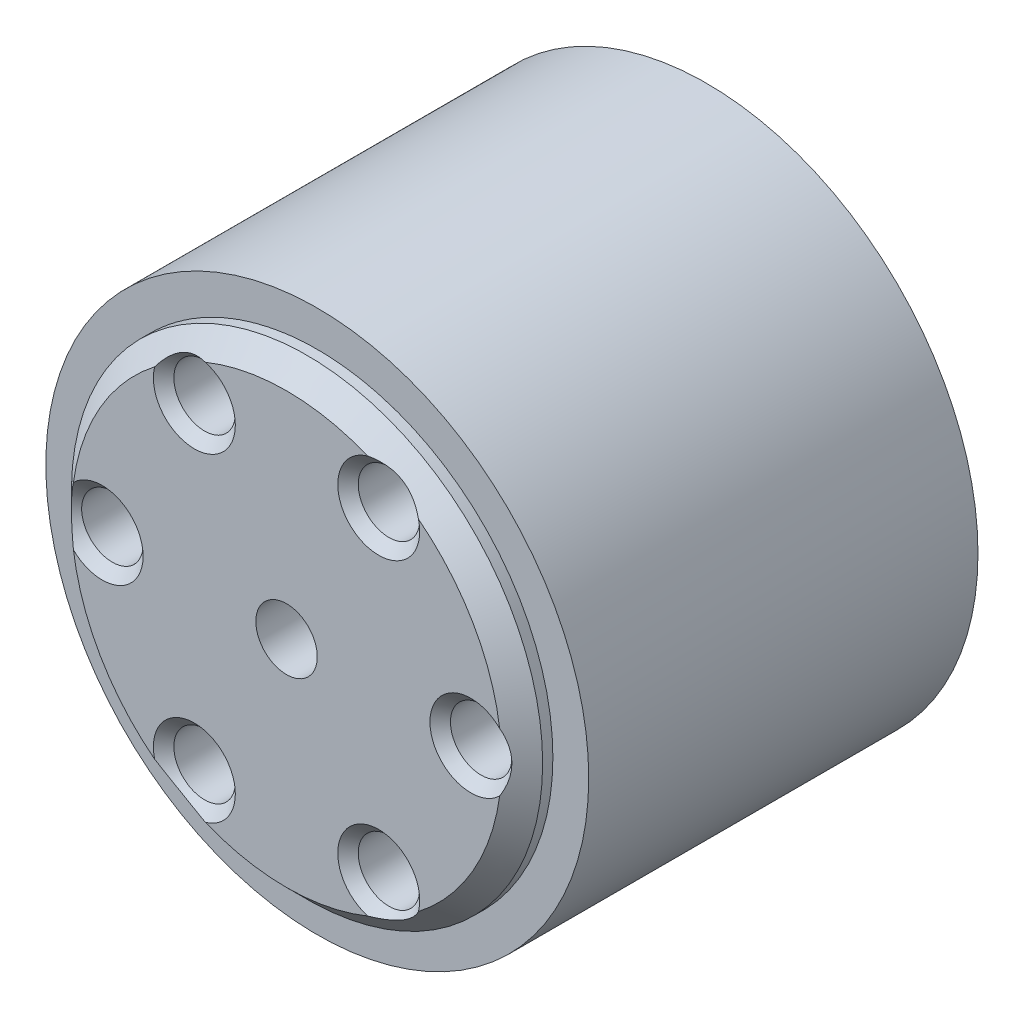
ISO-10303-21;
HEADER;
FILE_DESCRIPTION(('STEP AP214'),'2;1');
FILE_NAME('part.step','',(''),(''),'','','');
FILE_SCHEMA(('AUTOMOTIVE_DESIGN { 1 0 10303 214 1 1 1 1 }'));
ENDSEC;
DATA;
#1=APPLICATION_CONTEXT('core data for automotive mechanical design processes');
#2=APPLICATION_PROTOCOL_DEFINITION('international standard','automotive_design',2000,#1);
#3=PRODUCT_CONTEXT('',#1,'mechanical');
#4=PRODUCT('Part','Part','',(#3));
#5=PRODUCT_RELATED_PRODUCT_CATEGORY('part','',(#4));
#6=PRODUCT_DEFINITION_FORMATION('','',#4);
#7=PRODUCT_DEFINITION_CONTEXT('part definition',#1,'design');
#8=PRODUCT_DEFINITION('design','',#6,#7);
#9=PRODUCT_DEFINITION_SHAPE('','',#8);
#10=(LENGTH_UNIT() NAMED_UNIT(*) SI_UNIT(.MILLI.,.METRE.));
#11=(NAMED_UNIT(*) PLANE_ANGLE_UNIT() SI_UNIT($,.RADIAN.));
#12=(NAMED_UNIT(*) SI_UNIT($,.STERADIAN.) SOLID_ANGLE_UNIT());
#13=UNCERTAINTY_MEASURE_WITH_UNIT(LENGTH_MEASURE(1.E-05),#10,'distance_accuracy_value','');
#14=(GEOMETRIC_REPRESENTATION_CONTEXT(3) GLOBAL_UNCERTAINTY_ASSIGNED_CONTEXT((#13)) GLOBAL_UNIT_ASSIGNED_CONTEXT((#10,
#11,#12)) REPRESENTATION_CONTEXT('',''));
#15=CARTESIAN_POINT('',(0.,0.,0.));
#16=DIRECTION('',(0.,0.,1.));
#17=DIRECTION('',(1.,0.,0.));
#18=AXIS2_PLACEMENT_3D('',#15,#16,#17);
#19=CARTESIAN_POINT('',(0.,0.,9.5));
#20=DIRECTION('',(0.,0.,1.));
#21=DIRECTION('',(1.,0.,0.));
#22=AXIS2_PLACEMENT_3D('',#19,#20,#21);
#23=PLANE('',#22);
#24=CARTESIAN_POINT('',(0.,0.,9.5));
#25=DIRECTION('',(0.,0.,1.));
#26=DIRECTION('',(1.,0.,0.));
#27=AXIS2_PLACEMENT_3D('',#24,#25,#26);
#28=CIRCLE('',#27,13.25);
#29=CARTESIAN_POINT('',(13.25,0.,9.5));
#30=VERTEX_POINT('',#29);
#31=EDGE_CURVE('E11',#30,#30,#28,.T.);
#32=ORIENTED_EDGE('',*,*,#31,.T.);
#33=EDGE_LOOP('',(#32));
#34=FACE_BOUND('',#33,.T.);
#35=CARTESIAN_POINT('',(0.,0.,9.5));
#36=DIRECTION('',(0.,0.,1.));
#37=DIRECTION('',(1.,0.,0.));
#38=AXIS2_PLACEMENT_3D('',#35,#36,#37);
#39=CIRCLE('',#38,11.5);
#40=CARTESIAN_POINT('',(11.5,0.,9.5));
#41=VERTEX_POINT('',#40);
#42=EDGE_CURVE('E71',#41,#41,#39,.T.);
#43=ORIENTED_EDGE('',*,*,#42,.F.);
#44=EDGE_LOOP('',(#43));
#45=FACE_BOUND('',#44,.T.);
#46=ADVANCED_FACE('F57',(#34,#45),#23,.T.);
#47=CARTESIAN_POINT('',(0.,0.,-9.5));
#48=DIRECTION('',(0.,0.,1.));
#49=DIRECTION('',(1.,0.,0.));
#50=AXIS2_PLACEMENT_3D('',#47,#48,#49);
#51=PLANE('',#50);
#52=CARTESIAN_POINT('',(0.,0.,-9.5));
#53=DIRECTION('',(0.,0.,1.));
#54=DIRECTION('',(1.,0.,0.));
#55=AXIS2_PLACEMENT_3D('',#52,#53,#54);
#56=CIRCLE('',#55,13.25);
#57=CARTESIAN_POINT('',(13.25,0.,-9.5));
#58=VERTEX_POINT('',#57);
#59=EDGE_CURVE('E61',#58,#58,#56,.T.);
#60=ORIENTED_EDGE('',*,*,#59,.F.);
#61=EDGE_LOOP('',(#60));
#62=FACE_BOUND('',#61,.T.);
#63=CARTESIAN_POINT('',(0.,0.,-9.5));
#64=DIRECTION('',(0.,0.,1.));
#65=DIRECTION('',(1.,0.,0.));
#66=AXIS2_PLACEMENT_3D('',#63,#64,#65);
#67=CIRCLE('',#66,11.5);
#68=CARTESIAN_POINT('',(11.5,0.,-9.5));
#69=VERTEX_POINT('',#68);
#70=EDGE_CURVE('E73',#69,#69,#67,.T.);
#71=ORIENTED_EDGE('',*,*,#70,.T.);
#72=EDGE_LOOP('',(#71));
#73=FACE_BOUND('',#72,.T.);
#74=ADVANCED_FACE('F84',(#62,#73),#51,.F.);
#75=CARTESIAN_POINT('',(0.,0.,9.5));
#76=DIRECTION('',(0.,0.,-1.));
#77=DIRECTION('',(-1.,0.,0.));
#78=AXIS2_PLACEMENT_3D('',#75,#76,#77);
#79=CYLINDRICAL_SURFACE('',#78,13.25);
#80=ORIENTED_EDGE('',*,*,#31,.F.);
#81=EDGE_LOOP('',(#80));
#82=FACE_BOUND('',#81,.T.);
#83=ORIENTED_EDGE('',*,*,#59,.T.);
#84=EDGE_LOOP('',(#83));
#85=FACE_BOUND('',#84,.T.);
#86=ADVANCED_FACE('F59',(#82,#85),#79,.T.);
#87=CARTESIAN_POINT('',(0.,0.,9.5));
#88=DIRECTION('',(0.,0.,-1.));
#89=DIRECTION('',(-1.,0.,0.));
#90=AXIS2_PLACEMENT_3D('',#87,#88,#89);
#91=CYLINDRICAL_SURFACE('',#90,11.5);
#92=ORIENTED_EDGE('',*,*,#42,.T.);
#93=EDGE_LOOP('',(#92));
#94=FACE_BOUND('',#93,.T.);
#95=ORIENTED_EDGE('',*,*,#70,.F.);
#96=EDGE_LOOP('',(#95));
#97=FACE_BOUND('',#96,.T.);
#98=ADVANCED_FACE('F80',(#94,#97),#91,.F.);
#99=CLOSED_SHELL('',(#46,#74,#86,#98));
#100=MANIFOLD_SOLID_BREP('B2',#99);
#101=CARTESIAN_POINT('',(0.,0.,11.));
#102=DIRECTION('',(0.,0.,-1.));
#103=DIRECTION('',(-1.,0.,0.));
#104=AXIS2_PLACEMENT_3D('',#101,#102,#103);
#105=CYLINDRICAL_SURFACE('',#104,11.5);
#106=CARTESIAN_POINT('',(0.,0.,-10.));
#107=DIRECTION('',(0.,0.,1.));
#108=DIRECTION('',(1.,0.,0.));
#109=AXIS2_PLACEMENT_3D('',#106,#107,#108);
#110=CIRCLE('',#109,11.5);
#111=CARTESIAN_POINT('',(11.5,0.,-10.));
#112=VERTEX_POINT('',#111);
#113=EDGE_CURVE('E288',#112,#112,#110,.T.);
#114=ORIENTED_EDGE('',*,*,#113,.T.);
#115=EDGE_LOOP('',(#114));
#116=FACE_BOUND('',#115,.T.);
#117=CARTESIAN_POINT('',(0.,0.,10.));
#118=DIRECTION('',(0.,0.,1.));
#119=DIRECTION('',(1.,0.,0.));
#120=AXIS2_PLACEMENT_3D('',#117,#118,#119);
#121=CIRCLE('',#120,11.5);
#122=CARTESIAN_POINT('',(11.5,0.,10.));
#123=VERTEX_POINT('',#122);
#124=EDGE_CURVE('E275',#123,#123,#121,.F.);
#125=ORIENTED_EDGE('',*,*,#124,.T.);
#126=EDGE_LOOP('',(#125));
#127=FACE_BOUND('',#126,.T.);
#128=ADVANCED_FACE('F119',(#116,#127),#105,.T.);
#129=CARTESIAN_POINT('',(0.,0.,11.));
#130=DIRECTION('',(0.,0.,1.));
#131=DIRECTION('',(1.,0.,0.));
#132=AXIS2_PLACEMENT_3D('',#129,#130,#131);
#133=PLANE('',#132);
#134=CARTESIAN_POINT('',(0.,0.,11.));
#135=DIRECTION('',(0.,0.,-1.));
#136=DIRECTION('',(-1.,0.,0.));
#137=AXIS2_PLACEMENT_3D('',#134,#135,#136);
#138=CIRCLE('',#137,1.5);
#139=CARTESIAN_POINT('',(-1.5,0.,11.));
#140=VERTEX_POINT('',#139);
#141=EDGE_CURVE('E284',#140,#140,#138,.T.);
#142=ORIENTED_EDGE('',*,*,#141,.T.);
#143=EDGE_LOOP('',(#142));
#144=FACE_BOUND('',#143,.T.);
#145=CARTESIAN_POINT('',(0.,0.,11.));
#146=DIRECTION('',(0.,0.,1.));
#147=DIRECTION('',(1.,0.,0.));
#148=AXIS2_PLACEMENT_3D('',#145,#146,#147);
#149=CIRCLE('',#148,10.5);
#150=CARTESIAN_POINT('',(10.4027777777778,1.42555761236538,11.));
#151=VERTEX_POINT('',#150);
#152=CARTESIAN_POINT('',(6.4359579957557,8.29629101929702,11.));
#153=VERTEX_POINT('',#152);
#154=EDGE_CURVE('E238',#151,#153,#149,.T.);
#155=ORIENTED_EDGE('',*,*,#154,.T.);
#156=CARTESIAN_POINT('',(4.50000000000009,7.79422863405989,11.));
#157=DIRECTION('',(0.,0.,1.));
#158=DIRECTION('',(1.,0.,0.));
#159=AXIS2_PLACEMENT_3D('',#156,#157,#158);
#160=CIRCLE('',#159,2.00000000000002);
#161=CARTESIAN_POINT('',(3.96681978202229,9.72184863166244,11.));
#162=VERTEX_POINT('',#161);
#163=EDGE_CURVE('E441',#153,#162,#160,.F.);
#164=ORIENTED_EDGE('',*,*,#163,.T.);
#165=CARTESIAN_POINT('',(-3.96681978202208,9.72184863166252,11.));
#166=VERTEX_POINT('',#165);
#167=EDGE_CURVE('E297',#162,#166,#149,.T.);
#168=ORIENTED_EDGE('',*,*,#167,.T.);
#169=CARTESIAN_POINT('',(-4.49999999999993,7.79422863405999,11.));
#170=DIRECTION('',(0.,0.,1.));
#171=DIRECTION('',(1.,0.,0.));
#172=AXIS2_PLACEMENT_3D('',#169,#170,#171);
#173=CIRCLE('',#172,2.00000000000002);
#174=CARTESIAN_POINT('',(-6.43595799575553,8.29629101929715,11.));
#175=VERTEX_POINT('',#174);
#176=EDGE_CURVE('E460',#166,#175,#173,.F.);
#177=ORIENTED_EDGE('',*,*,#176,.T.);
#178=CARTESIAN_POINT('',(-10.4027777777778,1.42555761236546,11.));
#179=VERTEX_POINT('',#178);
#180=EDGE_CURVE('E300',#175,#179,#149,.T.);
#181=ORIENTED_EDGE('',*,*,#180,.T.);
#182=CARTESIAN_POINT('',(-9.,0.,11.));
#183=DIRECTION('',(0.,0.,1.));
#184=DIRECTION('',(1.,0.,0.));
#185=AXIS2_PLACEMENT_3D('',#182,#183,#184);
#186=CIRCLE('',#185,2.00000000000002);
#187=CARTESIAN_POINT('',(-10.4027777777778,-1.42555761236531,11.));
#188=VERTEX_POINT('',#187);
#189=EDGE_CURVE('E457',#179,#188,#186,.F.);
#190=ORIENTED_EDGE('',*,*,#189,.T.);
#191=CARTESIAN_POINT('',(-6.43595799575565,-8.29629101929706,11.));
#192=VERTEX_POINT('',#191);
#193=EDGE_CURVE('E737',#188,#192,#149,.T.);
#194=ORIENTED_EDGE('',*,*,#193,.T.);
#195=CARTESIAN_POINT('',(-4.50000000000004,-7.79422863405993,11.));
#196=DIRECTION('',(0.,0.,1.));
#197=DIRECTION('',(1.,0.,0.));
#198=AXIS2_PLACEMENT_3D('',#195,#196,#197);
#199=CIRCLE('',#198,2.00000000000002);
#200=CARTESIAN_POINT('',(-3.96681978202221,-9.72184863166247,11.));
#201=VERTEX_POINT('',#200);
#202=EDGE_CURVE('E453',#192,#201,#199,.F.);
#203=ORIENTED_EDGE('',*,*,#202,.T.);
#204=CARTESIAN_POINT('',(3.96681978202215,-9.72184863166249,11.));
#205=VERTEX_POINT('',#204);
#206=EDGE_CURVE('E735',#201,#205,#149,.T.);
#207=ORIENTED_EDGE('',*,*,#206,.T.);
#208=CARTESIAN_POINT('',(4.49999999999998,-7.79422863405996,11.));
#209=DIRECTION('',(0.,0.,1.));
#210=DIRECTION('',(1.,0.,0.));
#211=AXIS2_PLACEMENT_3D('',#208,#209,#210);
#212=CIRCLE('',#211,2.00000000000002);
#213=CARTESIAN_POINT('',(6.43595799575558,-8.29629101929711,11.));
#214=VERTEX_POINT('',#213);
#215=EDGE_CURVE('E449',#205,#214,#212,.F.);
#216=ORIENTED_EDGE('',*,*,#215,.T.);
#217=CARTESIAN_POINT('',(10.4027777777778,-1.42555761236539,11.));
#218=VERTEX_POINT('',#217);
#219=EDGE_CURVE('E296',#214,#218,#149,.T.);
#220=ORIENTED_EDGE('',*,*,#219,.T.);
#221=CARTESIAN_POINT('',(9.,0.,11.));
#222=DIRECTION('',(0.,0.,1.));
#223=DIRECTION('',(1.,0.,0.));
#224=AXIS2_PLACEMENT_3D('',#221,#222,#223);
#225=CIRCLE('',#224,2.00000000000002);
#226=EDGE_CURVE('E445',#218,#151,#225,.F.);
#227=ORIENTED_EDGE('',*,*,#226,.T.);
#228=EDGE_LOOP('',(#155,#164,#168,#177,#181,#190,#194,#203,#207,#216,#220,#227));
#229=FACE_BOUND('',#228,.T.);
#230=ADVANCED_FACE('F398',(#144,#229),#133,.T.);
#231=CARTESIAN_POINT('',(0.,0.,-11.));
#232=DIRECTION('',(0.,0.,1.));
#233=DIRECTION('',(1.,0.,0.));
#234=AXIS2_PLACEMENT_3D('',#231,#232,#233);
#235=PLANE('',#234);
#236=CARTESIAN_POINT('',(0.,0.,-11.));
#237=DIRECTION('',(0.,0.,-1.));
#238=DIRECTION('',(-1.,0.,0.));
#239=AXIS2_PLACEMENT_3D('',#236,#237,#238);
#240=CIRCLE('',#239,9.);
#241=CARTESIAN_POINT('',(-9.,0.,-11.));
#242=VERTEX_POINT('',#241);
#243=EDGE_CURVE('E279',#242,#242,#240,.T.);
#244=ORIENTED_EDGE('',*,*,#243,.F.);
#245=EDGE_LOOP('',(#244));
#246=FACE_BOUND('',#245,.T.);
#247=CARTESIAN_POINT('',(0.,0.,-11.));
#248=DIRECTION('',(0.,0.,1.));
#249=DIRECTION('',(1.,0.,0.));
#250=AXIS2_PLACEMENT_3D('',#247,#248,#249);
#251=CIRCLE('',#250,10.5);
#252=CARTESIAN_POINT('',(10.5,0.,-11.));
#253=VERTEX_POINT('',#252);
#254=EDGE_CURVE('E292',#253,#253,#251,.F.);
#255=ORIENTED_EDGE('',*,*,#254,.T.);
#256=EDGE_LOOP('',(#255));
#257=FACE_BOUND('',#256,.T.);
#258=ADVANCED_FACE('F402',(#246,#257),#235,.F.);
#259=CARTESIAN_POINT('',(0.,0.,-10.));
#260=DIRECTION('',(0.,0.,1.));
#261=DIRECTION('',(1.,0.,0.));
#262=AXIS2_PLACEMENT_3D('',#259,#260,#261);
#263=CONICAL_SURFACE('',#262,11.5,0.785398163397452);
#264=ORIENTED_EDGE('',*,*,#254,.F.);
#265=EDGE_LOOP('',(#264));
#266=FACE_BOUND('',#265,.T.);
#267=ORIENTED_EDGE('',*,*,#113,.F.);
#268=EDGE_LOOP('',(#267));
#269=FACE_BOUND('',#268,.T.);
#270=ADVANCED_FACE('F336',(#266,#269),#263,.T.);
#271=CARTESIAN_POINT('',(0.,0.,11.));
#272=DIRECTION('',(0.,0.,-1.));
#273=DIRECTION('',(-1.,0.,0.));
#274=AXIS2_PLACEMENT_3D('',#271,#272,#273);
#275=CONICAL_SURFACE('',#274,10.5,0.785398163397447);
#276=ORIENTED_EDGE('',*,*,#124,.F.);
#277=EDGE_LOOP('',(#276));
#278=FACE_BOUND('',#277,.T.);
#279=CARTESIAN_POINT('',(3.96681978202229,9.72184863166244,11.));
#280=CARTESIAN_POINT('',(4.04800281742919,9.71708165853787,10.9737464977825));
#281=CARTESIAN_POINT('',(4.129597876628,9.70947056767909,10.9491180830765));
#282=CARTESIAN_POINT('',(4.29319020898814,9.68814308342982,10.9035233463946));
#283=CARTESIAN_POINT('',(4.37518796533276,9.67441406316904,10.8825647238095));
#284=CARTESIAN_POINT('',(4.53868487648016,9.64047863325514,10.8448658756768));
#285=CARTESIAN_POINT('',(4.62018463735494,9.62028314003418,10.8281186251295));
#286=CARTESIAN_POINT('',(4.78196835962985,9.57317895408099,10.7992477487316));
#287=CARTESIAN_POINT('',(4.86225360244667,9.54627794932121,10.7871188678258));
#288=CARTESIAN_POINT('',(5.01607259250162,9.48750071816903,10.7683938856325));
#289=CARTESIAN_POINT('',(5.08972225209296,9.45602027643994,10.7615092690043));
#290=CARTESIAN_POINT('',(5.23445067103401,9.38720677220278,10.7523148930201));
#291=CARTESIAN_POINT('',(5.30553195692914,9.34987966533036,10.7500005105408));
#292=CARTESIAN_POINT('',(5.4352411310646,9.27499356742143,10.7499995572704));
#293=CARTESIAN_POINT('',(5.49426910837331,9.23812389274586,10.7517391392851));
#294=CARTESIAN_POINT('',(5.60952052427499,9.16048653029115,10.7586584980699));
#295=CARTESIAN_POINT('',(5.66574301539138,9.11971753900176,10.7638394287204));
#296=CARTESIAN_POINT('',(5.77518531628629,9.0345388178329,10.777552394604));
#297=CARTESIAN_POINT('',(5.82839605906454,8.99011898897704,10.786093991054));
#298=CARTESIAN_POINT('',(5.93140703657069,8.89815566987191,10.8063526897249));
#299=CARTESIAN_POINT('',(5.98120634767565,8.85061134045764,10.8180706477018));
#300=CARTESIAN_POINT('',(6.10647601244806,8.72305303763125,10.852511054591));
#301=CARTESIAN_POINT('',(6.17913714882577,8.64087890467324,10.8775917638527));
#302=CARTESIAN_POINT('',(6.28086142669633,8.5139788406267,10.920098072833));
#303=CARTESIAN_POINT('',(6.31348393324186,8.47118656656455,10.9350365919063));
#304=CARTESIAN_POINT('',(6.37642637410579,8.38451771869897,10.9664186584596));
#305=CARTESIAN_POINT('',(6.40674773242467,8.34064183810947,10.9828612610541));
#306=CARTESIAN_POINT('',(6.4359579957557,8.29629101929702,11.));
#307=B_SPLINE_CURVE_WITH_KNOTS('',3,(#279,#280,#281,#282,#283,#284,#285,#286,#287,#288,#289,
#290,#291,#292,#293,#294,#295,#296,#297,#298,#299,#300,#301,#302,#303,#304,#305,#306),
.UNSPECIFIED.,.F.,.F.,(4,2,2,2,2,2,2,2,2,2,2,2,2,4),(0.,0.25638001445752,0.513291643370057,
0.769771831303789,1.02595930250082,1.26676216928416,1.50732132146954,1.71592883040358,
1.92460632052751,2.13388184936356,2.3432138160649,2.67986879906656,2.84734051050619,
3.01470772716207),.UNSPECIFIED.);
#308=EDGE_CURVE('E368',#162,#153,#307,.T.);
#309=ORIENTED_EDGE('',*,*,#308,.T.);
#310=ORIENTED_EDGE('',*,*,#154,.F.);
#311=CARTESIAN_POINT('',(10.4027777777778,1.42555761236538,11.));
#312=CARTESIAN_POINT('',(10.4392409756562,1.35286755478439,10.9737464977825));
#313=CARTESIAN_POINT('',(10.4734471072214,1.27839861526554,10.9491180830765));
#314=CARTESIAN_POINT('',(10.5367731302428,1.12605975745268,10.9035233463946));
#315=CARTESIAN_POINT('',(10.5658823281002,1.04818310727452,10.8825647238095));
#316=CARTESIAN_POINT('',(10.6182418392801,0.889622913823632,10.8448658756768));
#317=CARTESIAN_POINT('',(10.6415019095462,0.808944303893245,10.8281186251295));
#318=CARTESIAN_POINT('',(10.6816003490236,0.645283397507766,10.7992477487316));
#319=CARTESIAN_POINT('',(10.6984460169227,0.562303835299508,10.7871188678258));
#320=CARTESIAN_POINT('',(10.7244529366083,0.39970406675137,10.7683938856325));
#321=CARTESIAN_POINT('',(10.7340149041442,0.320181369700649,10.7615092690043));
#322=CARTESIAN_POINT('',(10.7467848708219,0.160436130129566,10.7523148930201));
#323=CARTESIAN_POINT('',(10.7499992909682,0.0802143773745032,10.7500005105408));
#324=CARTESIAN_POINT('',(10.7500006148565,-0.0695601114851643,10.7499995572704));
#325=CARTESIAN_POINT('',(10.7475845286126,-0.139114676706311,10.7517391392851));
#326=CARTESIAN_POINT('',(10.7379743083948,-0.277744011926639,10.7586584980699));
#327=CARTESIAN_POINT('',(10.7307785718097,-0.346818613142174,10.7638394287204));
#328=CARTESIAN_POINT('',(10.7117327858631,-0.484187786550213,10.777552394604));
#329=CARTESIAN_POINT('',(10.6998694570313,-0.552479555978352,10.786093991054));
#330=CARTESIAN_POINT('',(10.671732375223,-0.687671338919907,10.8063526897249));
#331=CARTESIAN_POINT('',(10.6554574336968,-0.754570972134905,10.8180706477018));
#332=CARTESIAN_POINT('',(10.6076235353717,-0.92683683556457,10.852511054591));
#333=CARTESIAN_POINT('',(10.572789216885,-1.03085029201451,10.8775917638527));
#334=CARTESIAN_POINT('',(10.5137526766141,-1.18239613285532,10.920098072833));
#335=CARTESIAN_POINT('',(10.4930047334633,-1.23204418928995,10.9350365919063));
#336=CARTESIAN_POINT('',(10.449418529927,-1.3298883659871,10.9664186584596));
#337=CARTESIAN_POINT('',(10.4265815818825,-1.37808537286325,10.9828612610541));
#338=CARTESIAN_POINT('',(10.4027777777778,-1.42555761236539,11.));
#339=B_SPLINE_CURVE_WITH_KNOTS('',3,(#311,#312,#313,#314,#315,#316,#317,#318,#319,#320,#321,
#322,#323,#324,#325,#326,#327,#328,#329,#330,#331,#332,#333,#334,#335,#336,#337,#338),
.UNSPECIFIED.,.F.,.F.,(4,2,2,2,2,2,2,2,2,2,2,2,2,4),(0.,0.256380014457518,0.513291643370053,
0.769771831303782,1.02595930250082,1.26676216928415,1.50732132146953,1.71592883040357,
1.9246063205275,2.13388184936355,2.34321381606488,2.67986879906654,2.84734051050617,
3.01470772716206),.UNSPECIFIED.);
#340=EDGE_CURVE('E361',#151,#218,#339,.T.);
#341=ORIENTED_EDGE('',*,*,#340,.T.);
#342=ORIENTED_EDGE('',*,*,#219,.F.);
#343=CARTESIAN_POINT('',(6.43595799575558,-8.29629101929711,11.));
#344=CARTESIAN_POINT('',(6.3912381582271,-8.36421410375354,10.9737464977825));
#345=CARTESIAN_POINT('',(6.34384923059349,-8.43107195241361,10.9491180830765));
#346=CARTESIAN_POINT('',(6.24358292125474,-8.56208332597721,10.9035233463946));
#347=CARTESIAN_POINT('',(6.19069436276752,-8.62623095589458,10.8825647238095));
#348=CARTESIAN_POINT('',(6.07955696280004,-8.75085571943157,10.8448658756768));
#349=CARTESIAN_POINT('',(6.02131727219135,-8.811338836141,10.8281186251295));
#350=CARTESIAN_POINT('',(5.89963198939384,-8.92789555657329,10.7992477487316));
#351=CARTESIAN_POINT('',(5.83619241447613,-8.98397411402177,10.7871188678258));
#352=CARTESIAN_POINT('',(5.70838034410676,-9.08779665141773,10.7683938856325));
#353=CARTESIAN_POINT('',(5.64429265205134,-9.13583890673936,10.7615092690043));
#354=CARTESIAN_POINT('',(5.51233419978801,-9.22677064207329,10.7523148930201));
#355=CARTESIAN_POINT('',(5.44446733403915,-9.26966528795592,10.7500005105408));
#356=CARTESIAN_POINT('',(5.31475948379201,-9.34455367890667,10.7499995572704));
#357=CARTESIAN_POINT('',(5.25331542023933,-9.37723856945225,10.7517391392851));
#358=CARTESIAN_POINT('',(5.1284537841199,-9.43823054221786,10.7586584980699));
#359=CARTESIAN_POINT('',(5.06503555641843,-9.46653615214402,10.7638394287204));
#360=CARTESIAN_POINT('',(4.93654746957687,-9.5187266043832,10.777552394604));
#361=CARTESIAN_POINT('',(4.87147339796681,-9.54259854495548,10.786093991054));
#362=CARTESIAN_POINT('',(4.74032533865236,-9.5858270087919,10.8063526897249));
#363=CARTESIAN_POINT('',(4.67425108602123,-9.60518231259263,10.8180706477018));
#364=CARTESIAN_POINT('',(4.50114752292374,-9.6498898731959,10.852511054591));
#365=CARTESIAN_POINT('',(4.39365206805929,-9.67172919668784,10.8775917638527));
#366=CARTESIAN_POINT('',(4.23289124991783,-9.6963749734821,10.920098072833));
#367=CARTESIAN_POINT('',(4.17952080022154,-9.70323075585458,10.9350365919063));
#368=CARTESIAN_POINT('',(4.07299215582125,-9.71440608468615,10.9664186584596));
#369=CARTESIAN_POINT('',(4.01983384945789,-9.7187272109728,10.9828612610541));
#370=CARTESIAN_POINT('',(3.96681978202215,-9.72184863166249,11.));
#371=B_SPLINE_CURVE_WITH_KNOTS('',3,(#343,#344,#345,#346,#347,#348,#349,#350,#351,#352,#353,
#354,#355,#356,#357,#358,#359,#360,#361,#362,#363,#364,#365,#366,#367,#368,#369,#370),
.UNSPECIFIED.,.F.,.F.,(4,2,2,2,2,2,2,2,2,2,2,2,2,4),(0.,0.256380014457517,0.513291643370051,
0.76977183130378,1.02595930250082,1.26676216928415,1.50732132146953,1.71592883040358,
1.9246063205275,2.13388184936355,2.34321381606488,2.67986879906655,2.84734051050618,
3.01470772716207),.UNSPECIFIED.);
#372=EDGE_CURVE('E354',#214,#205,#371,.T.);
#373=ORIENTED_EDGE('',*,*,#372,.T.);
#374=ORIENTED_EDGE('',*,*,#206,.F.);
#375=CARTESIAN_POINT('',(-3.96681978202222,-9.72184863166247,11.));
#376=CARTESIAN_POINT('',(-4.04800281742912,-9.7170816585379,10.9737464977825));
#377=CARTESIAN_POINT('',(-4.12959787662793,-9.70947056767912,10.9491180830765));
#378=CARTESIAN_POINT('',(-4.29319020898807,-9.68814308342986,10.9035233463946));
#379=CARTESIAN_POINT('',(-4.37518796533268,-9.67441406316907,10.8825647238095));
#380=CARTESIAN_POINT('',(-4.53868487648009,-9.64047863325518,10.8448658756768));
#381=CARTESIAN_POINT('',(-4.62018463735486,-9.62028314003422,10.8281186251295));
#382=CARTESIAN_POINT('',(-4.78196835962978,-9.57317895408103,10.7992477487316));
#383=CARTESIAN_POINT('',(-4.8622536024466,-9.54627794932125,10.7871188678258));
#384=CARTESIAN_POINT('',(-5.01607259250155,-9.48750071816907,10.7683938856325));
#385=CARTESIAN_POINT('',(-5.08972225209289,-9.45602027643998,10.7615092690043));
#386=CARTESIAN_POINT('',(-5.23445067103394,-9.38720677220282,10.7523148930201));
#387=CARTESIAN_POINT('',(-5.30553195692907,-9.34987966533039,10.7500005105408));
#388=CARTESIAN_POINT('',(-5.43524113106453,-9.27499356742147,10.7499995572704));
#389=CARTESIAN_POINT('',(-5.49426910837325,-9.2381238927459,10.7517391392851));
#390=CARTESIAN_POINT('',(-5.60952052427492,-9.16048653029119,10.7586584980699));
#391=CARTESIAN_POINT('',(-5.66574301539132,-9.11971753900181,10.7638394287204));
#392=CARTESIAN_POINT('',(-5.77518531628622,-9.03453881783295,10.777552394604));
#393=CARTESIAN_POINT('',(-5.82839605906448,-8.99011898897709,10.786093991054));
#394=CARTESIAN_POINT('',(-5.93140703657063,-8.89815566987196,10.8063526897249));
#395=CARTESIAN_POINT('',(-5.98120634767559,-8.85061134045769,10.8180706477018));
#396=CARTESIAN_POINT('',(-6.106476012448,-8.72305303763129,10.852511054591));
#397=CARTESIAN_POINT('',(-6.1791371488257,-8.64087890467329,10.8775917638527));
#398=CARTESIAN_POINT('',(-6.28086142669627,-8.51397884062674,10.920098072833));
#399=CARTESIAN_POINT('',(-6.3134839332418,-8.47118656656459,10.9350365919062));
#400=CARTESIAN_POINT('',(-6.37642637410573,-8.38451771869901,10.9664186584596));
#401=CARTESIAN_POINT('',(-6.40674773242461,-8.34064183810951,10.9828612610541));
#402=CARTESIAN_POINT('',(-6.43595799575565,-8.29629101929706,11.));
#403=B_SPLINE_CURVE_WITH_KNOTS('',3,(#375,#376,#377,#378,#379,#380,#381,#382,#383,#384,#385,
#386,#387,#388,#389,#390,#391,#392,#393,#394,#395,#396,#397,#398,#399,#400,#401,#402),
.UNSPECIFIED.,.F.,.F.,(4,2,2,2,2,2,2,2,2,2,2,2,2,4),(0.,0.25638001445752,0.513291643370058,
0.769771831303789,1.02595930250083,1.26676216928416,1.50732132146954,1.71592883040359,
1.92460632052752,2.13388184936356,2.3432138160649,2.67986879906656,2.84734051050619,
3.01470772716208),.UNSPECIFIED.);
#404=EDGE_CURVE('E347',#201,#192,#403,.T.);
#405=ORIENTED_EDGE('',*,*,#404,.T.);
#406=ORIENTED_EDGE('',*,*,#193,.F.);
#407=CARTESIAN_POINT('',(-10.4027777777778,-1.42555761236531,11.));
#408=CARTESIAN_POINT('',(-10.4392409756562,-1.35286755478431,10.9737464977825));
#409=CARTESIAN_POINT('',(-10.4734471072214,-1.27839861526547,10.9491180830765));
#410=CARTESIAN_POINT('',(-10.5367731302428,-1.12605975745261,10.9035233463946));
#411=CARTESIAN_POINT('',(-10.5658823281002,-1.04818310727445,10.8825647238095));
#412=CARTESIAN_POINT('',(-10.6182418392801,-0.889622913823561,10.8448658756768));
#413=CARTESIAN_POINT('',(-10.6415019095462,-0.808944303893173,10.8281186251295));
#414=CARTESIAN_POINT('',(-10.6816003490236,-0.645283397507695,10.7992477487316));
#415=CARTESIAN_POINT('',(-10.6984460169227,-0.562303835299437,10.7871188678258));
#416=CARTESIAN_POINT('',(-10.7244529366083,-0.399704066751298,10.7683938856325));
#417=CARTESIAN_POINT('',(-10.7340149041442,-0.320181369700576,10.7615092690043));
#418=CARTESIAN_POINT('',(-10.7467848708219,-0.160436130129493,10.7523148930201));
#419=CARTESIAN_POINT('',(-10.7499992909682,-0.0802143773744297,10.7500005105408));
#420=CARTESIAN_POINT('',(-10.7500006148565,0.069560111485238,10.7499995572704));
#421=CARTESIAN_POINT('',(-10.7475845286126,0.139114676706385,10.7517391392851));
#422=CARTESIAN_POINT('',(-10.7379743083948,0.277744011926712,10.7586584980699));
#423=CARTESIAN_POINT('',(-10.7307785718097,0.346818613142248,10.7638394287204));
#424=CARTESIAN_POINT('',(-10.7117327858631,0.484187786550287,10.777552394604));
#425=CARTESIAN_POINT('',(-10.6998694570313,0.552479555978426,10.786093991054));
#426=CARTESIAN_POINT('',(-10.671732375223,0.687671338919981,10.8063526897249));
#427=CARTESIAN_POINT('',(-10.6554574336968,0.754570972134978,10.8180706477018));
#428=CARTESIAN_POINT('',(-10.6076235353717,0.926836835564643,10.852511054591));
#429=CARTESIAN_POINT('',(-10.572789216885,1.03085029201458,10.8775917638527));
#430=CARTESIAN_POINT('',(-10.5137526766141,1.18239613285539,10.920098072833));
#431=CARTESIAN_POINT('',(-10.4930047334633,1.23204418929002,10.9350365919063));
#432=CARTESIAN_POINT('',(-10.4494185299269,1.32988836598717,10.9664186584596));
#433=CARTESIAN_POINT('',(-10.4265815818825,1.37808537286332,10.9828612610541));
#434=CARTESIAN_POINT('',(-10.4027777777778,1.42555761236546,11.));
#435=B_SPLINE_CURVE_WITH_KNOTS('',3,(#407,#408,#409,#410,#411,#412,#413,#414,#415,#416,#417,
#418,#419,#420,#421,#422,#423,#424,#425,#426,#427,#428,#429,#430,#431,#432,#433,#434),
.UNSPECIFIED.,.F.,.F.,(4,2,2,2,2,2,2,2,2,2,2,2,2,4),(0.,0.256380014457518,0.513291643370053,
0.769771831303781,1.02595930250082,1.26676216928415,1.50732132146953,1.71592883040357,
1.9246063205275,2.13388184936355,2.34321381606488,2.67986879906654,2.84734051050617,
3.01470772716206),.UNSPECIFIED.);
#436=EDGE_CURVE('E325',#188,#179,#435,.T.);
#437=ORIENTED_EDGE('',*,*,#436,.T.);
#438=ORIENTED_EDGE('',*,*,#180,.F.);
#439=CARTESIAN_POINT('',(-6.43595799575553,8.29629101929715,11.));
#440=CARTESIAN_POINT('',(-6.39123815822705,8.36421410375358,10.9737464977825));
#441=CARTESIAN_POINT('',(-6.34384923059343,8.43107195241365,10.9491180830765));
#442=CARTESIAN_POINT('',(-6.24358292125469,8.56208332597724,10.9035233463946));
#443=CARTESIAN_POINT('',(-6.19069436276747,8.62623095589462,10.8825647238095));
#444=CARTESIAN_POINT('',(-6.07955696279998,8.75085571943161,10.8448658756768));
#445=CARTESIAN_POINT('',(-6.02131727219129,8.81133883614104,10.8281186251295));
#446=CARTESIAN_POINT('',(-5.89963198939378,8.92789555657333,10.7992477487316));
#447=CARTESIAN_POINT('',(-5.83619241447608,8.98397411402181,10.7871188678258));
#448=CARTESIAN_POINT('',(-5.70838034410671,9.08779665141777,10.7683938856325));
#449=CARTESIAN_POINT('',(-5.64429265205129,9.1358389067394,10.7615092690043));
#450=CARTESIAN_POINT('',(-5.51233419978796,9.22677064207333,10.7523148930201));
#451=CARTESIAN_POINT('',(-5.44446733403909,9.26966528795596,10.7500005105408));
#452=CARTESIAN_POINT('',(-5.31475948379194,9.34455367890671,10.7499995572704));
#453=CARTESIAN_POINT('',(-5.25331542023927,9.37723856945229,10.7517391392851));
#454=CARTESIAN_POINT('',(-5.12845378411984,9.43823054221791,10.7586584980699));
#455=CARTESIAN_POINT('',(-5.06503555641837,9.46653615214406,10.7638394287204));
#456=CARTESIAN_POINT('',(-4.93654746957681,9.51872660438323,10.777552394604));
#457=CARTESIAN_POINT('',(-4.87147339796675,9.54259854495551,10.786093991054));
#458=CARTESIAN_POINT('',(-4.7403253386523,9.58582700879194,10.8063526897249));
#459=CARTESIAN_POINT('',(-4.67425108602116,9.60518231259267,10.8180706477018));
#460=CARTESIAN_POINT('',(-4.50114752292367,9.64988987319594,10.852511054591));
#461=CARTESIAN_POINT('',(-4.39365206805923,9.67172919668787,10.8775917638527));
#462=CARTESIAN_POINT('',(-4.23289124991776,9.69637497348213,10.920098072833));
#463=CARTESIAN_POINT('',(-4.17952080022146,9.70323075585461,10.9350365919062));
#464=CARTESIAN_POINT('',(-4.07299215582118,9.71440608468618,10.9664186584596));
#465=CARTESIAN_POINT('',(-4.01983384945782,9.71872721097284,10.9828612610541));
#466=CARTESIAN_POINT('',(-3.96681978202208,9.72184863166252,11.));
#467=B_SPLINE_CURVE_WITH_KNOTS('',3,(#439,#440,#441,#442,#443,#444,#445,#446,#447,#448,#449,
#450,#451,#452,#453,#454,#455,#456,#457,#458,#459,#460,#461,#462,#463,#464,#465,#466),
.UNSPECIFIED.,.F.,.F.,(4,2,2,2,2,2,2,2,2,2,2,2,2,4),(0.,0.256380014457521,0.513291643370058,
0.769771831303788,1.02595930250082,1.26676216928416,1.50732132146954,1.71592883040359,
1.92460632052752,2.13388184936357,2.3432138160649,2.67986879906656,2.8473405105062,
3.01470772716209),.UNSPECIFIED.);
#468=EDGE_CURVE('E317',#175,#166,#467,.T.);
#469=ORIENTED_EDGE('',*,*,#468,.T.);
#470=ORIENTED_EDGE('',*,*,#167,.F.);
#471=EDGE_LOOP('',(#309,#310,#341,#342,#373,#374,#405,#406,#437,#438,#469,#470));
#472=FACE_BOUND('',#471,.T.);
#473=ADVANCED_FACE('F331',(#278,#472),#275,.T.);
#474=CARTESIAN_POINT('',(0.,0.,3.5));
#475=DIRECTION('',(0.,0.,-1.));
#476=DIRECTION('',(-1.,0.,0.));
#477=AXIS2_PLACEMENT_3D('',#474,#475,#476);
#478=CYLINDRICAL_SURFACE('',#477,9.);
#479=CARTESIAN_POINT('',(0.,0.,3.5));
#480=DIRECTION('',(0.,0.,-1.));
#481=DIRECTION('',(-1.,0.,0.));
#482=AXIS2_PLACEMENT_3D('',#479,#480,#481);
#483=CIRCLE('',#482,9.);
#484=CARTESIAN_POINT('',(-8.87499999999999,1.49478259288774,3.5));
#485=VERTEX_POINT('',#484);
#486=CARTESIAN_POINT('',(-5.73201969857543,6.93858416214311,3.5));
#487=VERTEX_POINT('',#486);
#488=EDGE_CURVE('E270',#485,#487,#483,.T.);
#489=ORIENTED_EDGE('',*,*,#488,.F.);
#490=CARTESIAN_POINT('',(-8.87500000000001,-1.49478259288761,3.5));
#491=VERTEX_POINT('',#490);
#492=EDGE_CURVE('E283',#491,#485,#483,.T.);
#493=ORIENTED_EDGE('',*,*,#492,.F.);
#494=CARTESIAN_POINT('',(-5.73201969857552,-6.93858416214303,3.5));
#495=VERTEX_POINT('',#494);
#496=EDGE_CURVE('E512',#495,#491,#483,.T.);
#497=ORIENTED_EDGE('',*,*,#496,.F.);
#498=CARTESIAN_POINT('',(-3.14298030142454,-8.43336675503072,3.5));
#499=VERTEX_POINT('',#498);
#500=EDGE_CURVE('E518',#499,#495,#483,.T.);
#501=ORIENTED_EDGE('',*,*,#500,.F.);
#502=CARTESIAN_POINT('',(3.14298030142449,-8.43336675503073,3.5));
#503=VERTEX_POINT('',#502);
#504=EDGE_CURVE('E255',#503,#499,#483,.T.);
#505=ORIENTED_EDGE('',*,*,#504,.F.);
#506=CARTESIAN_POINT('',(5.73201969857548,-6.93858416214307,3.5));
#507=VERTEX_POINT('',#506);
#508=EDGE_CURVE('E243',#507,#503,#483,.T.);
#509=ORIENTED_EDGE('',*,*,#508,.F.);
#510=CARTESIAN_POINT('',(8.875,-1.49478259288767,3.5));
#511=VERTEX_POINT('',#510);
#512=EDGE_CURVE('E253',#511,#507,#483,.T.);
#513=ORIENTED_EDGE('',*,*,#512,.F.);
#514=CARTESIAN_POINT('',(8.875,1.49478259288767,3.5));
#515=VERTEX_POINT('',#514);
#516=EDGE_CURVE('E263',#515,#511,#483,.T.);
#517=ORIENTED_EDGE('',*,*,#516,.F.);
#518=CARTESIAN_POINT('',(6.11021482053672,6.60797055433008,3.5));
#519=VERTEX_POINT('',#518);
#520=EDGE_CURVE('E268',#519,#515,#483,.T.);
#521=ORIENTED_EDGE('',*,*,#520,.F.);
#522=CARTESIAN_POINT('',(6.11021482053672,6.60797055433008,3.5));
#523=CARTESIAN_POINT('',(6.04867758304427,6.66486962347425,3.58327625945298));
#524=CARTESIAN_POINT('',(5.98639270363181,6.7208702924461,3.66658105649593));
#525=CARTESIAN_POINT('',(5.86032766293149,6.83107482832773,3.83324772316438));
#526=CARTESIAN_POINT('',(5.79654750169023,6.88527869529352,3.91660959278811));
#527=CARTESIAN_POINT('',(5.73201969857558,6.93858416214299,4.00000000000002));
#528=B_SPLINE_CURVE_WITH_KNOTS('',3,(#522,#523,#524,#525,#526,#527),.UNSPECIFIED.,.F.,.F.,(4,2,
4),(0.,0.354396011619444,0.708792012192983),.UNSPECIFIED.);
#529=CARTESIAN_POINT('',(5.73201969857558,6.93858416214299,4.00000000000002));
#530=VERTEX_POINT('',#529);
#531=EDGE_CURVE('E55',#519,#530,#528,.T.);
#532=ORIENTED_EDGE('',*,*,#531,.T.);
#533=DIRECTION('',(0.,0.,-1.));
#534=VECTOR('',#533,1.);
#535=CARTESIAN_POINT('',(5.73201969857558,6.93858416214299,3.5));
#536=LINE('',#535,#534);
#537=CARTESIAN_POINT('',(5.73201969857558,6.93858416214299,3.5));
#538=VERTEX_POINT('',#537);
#539=EDGE_CURVE('E141',#538,#530,#536,.F.);
#540=ORIENTED_EDGE('',*,*,#539,.F.);
#541=CARTESIAN_POINT('',(3.1429803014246,8.43336675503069,3.5));
#542=VERTEX_POINT('',#541);
#543=EDGE_CURVE('E269',#542,#538,#483,.T.);
#544=ORIENTED_EDGE('',*,*,#543,.F.);
#545=DIRECTION('',(0.,0.,-1.));
#546=VECTOR('',#545,1.);
#547=CARTESIAN_POINT('',(3.1429803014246,8.43336675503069,4.00000000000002));
#548=LINE('',#547,#546);
#549=CARTESIAN_POINT('',(3.1429803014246,8.43336675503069,4.00000000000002));
#550=VERTEX_POINT('',#549);
#551=EDGE_CURVE('E310',#550,#542,#548,.T.);
#552=ORIENTED_EDGE('',*,*,#551,.F.);
#553=CARTESIAN_POINT('',(3.1429803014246,8.43336675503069,4.00000000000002));
#554=CARTESIAN_POINT('',(3.06455251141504,8.46259673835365,3.91660959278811));
#555=CARTESIAN_POINT('',(2.98572050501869,8.49073004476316,3.83324772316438));
#556=CARTESIAN_POINT('',(2.82724805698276,8.54480330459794,3.66658105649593));
#557=CARTESIAN_POINT('',(2.74760761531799,8.57074325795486,3.58327625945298));
#558=CARTESIAN_POINT('',(2.66756295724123,8.59558653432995,3.5));
#559=B_SPLINE_CURVE_WITH_KNOTS('',3,(#553,#554,#555,#556,#557,#558),.UNSPECIFIED.,.F.,.F.,(4,2,
4),(0.,0.354396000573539,0.708792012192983),.UNSPECIFIED.);
#560=CARTESIAN_POINT('',(2.66756295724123,8.59558653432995,3.5));
#561=VERTEX_POINT('',#560);
#562=EDGE_CURVE('E135',#550,#561,#559,.T.);
#563=ORIENTED_EDGE('',*,*,#562,.T.);
#564=CARTESIAN_POINT('',(-3.14298030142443,8.43336675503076,3.5));
#565=VERTEX_POINT('',#564);
#566=EDGE_CURVE('E505',#565,#561,#483,.T.);
#567=ORIENTED_EDGE('',*,*,#566,.F.);
#568=EDGE_CURVE('E276',#487,#565,#483,.T.);
#569=ORIENTED_EDGE('',*,*,#568,.F.);
#570=EDGE_LOOP('',(#489,#493,#497,#501,#505,#509,#513,#517,#521,#532,#540,#544,#552,#563,#567,#569));
#571=FACE_BOUND('',#570,.T.);
#572=ORIENTED_EDGE('',*,*,#243,.T.);
#573=EDGE_LOOP('',(#572));
#574=FACE_BOUND('',#573,.T.);
#575=ADVANCED_FACE('F250',(#571,#574),#478,.F.);
#576=CARTESIAN_POINT('',(0.,0.,3.5));
#577=DIRECTION('',(0.,0.,-1.));
#578=DIRECTION('',(-1.,0.,0.));
#579=AXIS2_PLACEMENT_3D('',#576,#577,#578);
#580=PLANE('',#579);
#581=ORIENTED_EDGE('',*,*,#566,.T.);
#582=CARTESIAN_POINT('',(4.50000000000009,7.79422863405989,3.5));
#583=DIRECTION('',(0.,0.,-1.));
#584=DIRECTION('',(-1.,0.,0.));
#585=AXIS2_PLACEMENT_3D('',#582,#583,#584);
#586=CIRCLE('',#585,2.00000000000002);
#587=EDGE_CURVE('E149',#561,#519,#586,.F.);
#588=ORIENTED_EDGE('',*,*,#587,.T.);
#589=ORIENTED_EDGE('',*,*,#520,.T.);
#590=CARTESIAN_POINT('',(9.,0.,3.5));
#591=DIRECTION('',(0.,0.,-1.));
#592=DIRECTION('',(-1.,0.,0.));
#593=AXIS2_PLACEMENT_3D('',#590,#591,#592);
#594=CIRCLE('',#593,1.5);
#595=EDGE_CURVE('E237',#511,#515,#594,.T.);
#596=ORIENTED_EDGE('',*,*,#595,.F.);
#597=ORIENTED_EDGE('',*,*,#512,.T.);
#598=CARTESIAN_POINT('',(4.49999999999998,-7.79422863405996,3.5));
#599=DIRECTION('',(0.,0.,-1.));
#600=DIRECTION('',(-1.,0.,0.));
#601=AXIS2_PLACEMENT_3D('',#598,#599,#600);
#602=CIRCLE('',#601,1.5);
#603=EDGE_CURVE('E228',#503,#507,#602,.T.);
#604=ORIENTED_EDGE('',*,*,#603,.F.);
#605=ORIENTED_EDGE('',*,*,#504,.T.);
#606=CARTESIAN_POINT('',(-4.50000000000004,-7.79422863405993,3.5));
#607=DIRECTION('',(0.,0.,-1.));
#608=DIRECTION('',(-1.,0.,0.));
#609=AXIS2_PLACEMENT_3D('',#606,#607,#608);
#610=CIRCLE('',#609,1.5);
#611=EDGE_CURVE('E246',#499,#495,#610,.F.);
#612=ORIENTED_EDGE('',*,*,#611,.T.);
#613=ORIENTED_EDGE('',*,*,#496,.T.);
#614=CARTESIAN_POINT('',(-9.,0.,3.5));
#615=DIRECTION('',(0.,0.,-1.));
#616=DIRECTION('',(-1.,0.,0.));
#617=AXIS2_PLACEMENT_3D('',#614,#615,#616);
#618=CIRCLE('',#617,1.5);
#619=EDGE_CURVE('E537',#491,#485,#618,.F.);
#620=ORIENTED_EDGE('',*,*,#619,.T.);
#621=ORIENTED_EDGE('',*,*,#488,.T.);
#622=CARTESIAN_POINT('',(-4.49999999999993,7.79422863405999,3.5));
#623=DIRECTION('',(0.,0.,-1.));
#624=DIRECTION('',(-1.,0.,0.));
#625=AXIS2_PLACEMENT_3D('',#622,#623,#624);
#626=CIRCLE('',#625,1.5);
#627=EDGE_CURVE('E535',#487,#565,#626,.F.);
#628=ORIENTED_EDGE('',*,*,#627,.T.);
#629=EDGE_LOOP('',(#581,#588,#589,#596,#597,#604,#605,#612,#613,#620,#621,#628));
#630=FACE_BOUND('',#629,.T.);
#631=CARTESIAN_POINT('',(0.,0.,3.5));
#632=DIRECTION('',(0.,0.,-1.));
#633=DIRECTION('',(-1.,0.,0.));
#634=AXIS2_PLACEMENT_3D('',#631,#632,#633);
#635=CIRCLE('',#634,1.5);
#636=CARTESIAN_POINT('',(-1.5,0.,3.5));
#637=VERTEX_POINT('',#636);
#638=EDGE_CURVE('E277',#637,#637,#635,.T.);
#639=ORIENTED_EDGE('',*,*,#638,.F.);
#640=EDGE_LOOP('',(#639));
#641=FACE_BOUND('',#640,.T.);
#642=ADVANCED_FACE('F259',(#630,#641),#580,.T.);
#643=CARTESIAN_POINT('',(0.,0.,11.));
#644=DIRECTION('',(0.,0.,-1.));
#645=DIRECTION('',(-1.,0.,0.));
#646=AXIS2_PLACEMENT_3D('',#643,#644,#645);
#647=CYLINDRICAL_SURFACE('',#646,1.5);
#648=ORIENTED_EDGE('',*,*,#141,.F.);
#649=EDGE_LOOP('',(#648));
#650=FACE_BOUND('',#649,.T.);
#651=ORIENTED_EDGE('',*,*,#638,.T.);
#652=EDGE_LOOP('',(#651));
#653=FACE_BOUND('',#652,.T.);
#654=ADVANCED_FACE('F576',(#650,#653),#647,.F.);
#655=CARTESIAN_POINT('',(0.,0.,3.5));
#656=DIRECTION('',(0.,0.,-1.));
#657=DIRECTION('',(-1.,0.,0.));
#658=AXIS2_PLACEMENT_3D('',#655,#656,#657);
#659=PLANE('',#658);
#660=CARTESIAN_POINT('',(4.49999999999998,-7.79422863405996,3.5));
#661=DIRECTION('',(0.,0.,-1.));
#662=DIRECTION('',(-1.,0.,0.));
#663=AXIS2_PLACEMENT_3D('',#660,#661,#662);
#664=CIRCLE('',#663,1.5);
#665=EDGE_CURVE('E231',#503,#507,#664,.F.);
#666=ORIENTED_EDGE('',*,*,#665,.T.);
#667=ORIENTED_EDGE('',*,*,#508,.T.);
#668=EDGE_LOOP('',(#666,#667));
#669=FACE_BOUND('',#668,.T.);
#670=ADVANCED_FACE('F242',(#669),#659,.F.);
#671=CARTESIAN_POINT('',(4.49999999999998,-7.79422863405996,-0.742640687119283));
#672=DIRECTION('',(0.,0.,1.));
#673=DIRECTION('',(1.,0.,0.));
#674=AXIS2_PLACEMENT_3D('',#671,#672,#673);
#675=CYLINDRICAL_SURFACE('',#674,1.5);
#676=CARTESIAN_POINT('',(4.49999999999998,-7.79422863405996,10.5));
#677=DIRECTION('',(0.,0.,1.));
#678=DIRECTION('',(1.,0.,0.));
#679=AXIS2_PLACEMENT_3D('',#676,#677,#678);
#680=CIRCLE('',#679,1.5);
#681=CARTESIAN_POINT('',(5.99999999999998,-7.79422863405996,10.5));
#682=VERTEX_POINT('',#681);
#683=EDGE_CURVE('E432',#682,#682,#680,.T.);
#684=ORIENTED_EDGE('',*,*,#683,.T.);
#685=EDGE_LOOP('',(#684));
#686=FACE_BOUND('',#685,.T.);
#687=ORIENTED_EDGE('',*,*,#665,.F.);
#688=ORIENTED_EDGE('',*,*,#603,.T.);
#689=EDGE_LOOP('',(#687,#688));
#690=FACE_BOUND('',#689,.T.);
#691=ADVANCED_FACE('F230',(#686,#690),#675,.F.);
#692=CARTESIAN_POINT('',(0.,0.,3.5));
#693=DIRECTION('',(0.,0.,-1.));
#694=DIRECTION('',(-1.,0.,0.));
#695=AXIS2_PLACEMENT_3D('',#692,#693,#694);
#696=PLANE('',#695);
#697=EDGE_CURVE('E529',#495,#499,#610,.F.);
#698=ORIENTED_EDGE('',*,*,#697,.T.);
#699=ORIENTED_EDGE('',*,*,#500,.T.);
#700=EDGE_LOOP('',(#698,#699));
#701=FACE_BOUND('',#700,.T.);
#702=ADVANCED_FACE('F639',(#701),#696,.F.);
#703=CARTESIAN_POINT('',(-4.50000000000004,-7.79422863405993,-0.742640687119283));
#704=DIRECTION('',(0.,0.,1.));
#705=DIRECTION('',(1.,0.,0.));
#706=AXIS2_PLACEMENT_3D('',#703,#704,#705);
#707=CYLINDRICAL_SURFACE('',#706,1.5);
#708=CARTESIAN_POINT('',(-4.50000000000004,-7.79422863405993,10.5));
#709=DIRECTION('',(0.,0.,1.));
#710=DIRECTION('',(1.,0.,0.));
#711=AXIS2_PLACEMENT_3D('',#708,#709,#710);
#712=CIRCLE('',#711,1.5);
#713=CARTESIAN_POINT('',(-3.00000000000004,-7.79422863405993,10.5));
#714=VERTEX_POINT('',#713);
#715=EDGE_CURVE('E428',#714,#714,#712,.T.);
#716=ORIENTED_EDGE('',*,*,#715,.T.);
#717=EDGE_LOOP('',(#716));
#718=FACE_BOUND('',#717,.T.);
#719=ORIENTED_EDGE('',*,*,#611,.F.);
#720=ORIENTED_EDGE('',*,*,#697,.F.);
#721=EDGE_LOOP('',(#719,#720));
#722=FACE_BOUND('',#721,.T.);
#723=ADVANCED_FACE('F634',(#718,#722),#707,.F.);
#724=CARTESIAN_POINT('',(0.,0.,3.5));
#725=DIRECTION('',(0.,0.,-1.));
#726=DIRECTION('',(-1.,0.,0.));
#727=AXIS2_PLACEMENT_3D('',#724,#725,#726);
#728=PLANE('',#727);
#729=EDGE_CURVE('E540',#485,#491,#618,.F.);
#730=ORIENTED_EDGE('',*,*,#729,.T.);
#731=ORIENTED_EDGE('',*,*,#492,.T.);
#732=EDGE_LOOP('',(#730,#731));
#733=FACE_BOUND('',#732,.T.);
#734=ADVANCED_FACE('F574',(#733),#728,.F.);
#735=CARTESIAN_POINT('',(-9.,0.,-0.742640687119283));
#736=DIRECTION('',(0.,0.,1.));
#737=DIRECTION('',(1.,0.,0.));
#738=AXIS2_PLACEMENT_3D('',#735,#736,#737);
#739=CYLINDRICAL_SURFACE('',#738,1.5);
#740=CARTESIAN_POINT('',(-9.,0.,10.5));
#741=DIRECTION('',(0.,0.,1.));
#742=DIRECTION('',(1.,0.,0.));
#743=AXIS2_PLACEMENT_3D('',#740,#741,#742);
#744=CIRCLE('',#743,1.5);
#745=CARTESIAN_POINT('',(-7.5,0.,10.5));
#746=VERTEX_POINT('',#745);
#747=EDGE_CURVE('E424',#746,#746,#744,.T.);
#748=ORIENTED_EDGE('',*,*,#747,.T.);
#749=EDGE_LOOP('',(#748));
#750=FACE_BOUND('',#749,.T.);
#751=ORIENTED_EDGE('',*,*,#619,.F.);
#752=ORIENTED_EDGE('',*,*,#729,.F.);
#753=EDGE_LOOP('',(#751,#752));
#754=FACE_BOUND('',#753,.T.);
#755=ADVANCED_FACE('F571',(#750,#754),#739,.F.);
#756=CARTESIAN_POINT('',(0.,0.,3.5));
#757=DIRECTION('',(0.,0.,-1.));
#758=DIRECTION('',(-1.,0.,0.));
#759=AXIS2_PLACEMENT_3D('',#756,#757,#758);
#760=PLANE('',#759);
#761=EDGE_CURVE('E544',#565,#487,#626,.F.);
#762=ORIENTED_EDGE('',*,*,#761,.T.);
#763=ORIENTED_EDGE('',*,*,#568,.T.);
#764=EDGE_LOOP('',(#762,#763));
#765=FACE_BOUND('',#764,.T.);
#766=ADVANCED_FACE('F561',(#765),#760,.F.);
#767=CARTESIAN_POINT('',(-4.49999999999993,7.79422863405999,-0.742640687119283));
#768=DIRECTION('',(0.,0.,1.));
#769=DIRECTION('',(1.,0.,0.));
#770=AXIS2_PLACEMENT_3D('',#767,#768,#769);
#771=CYLINDRICAL_SURFACE('',#770,1.5);
#772=CARTESIAN_POINT('',(-4.49999999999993,7.79422863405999,10.5));
#773=DIRECTION('',(0.,0.,1.));
#774=DIRECTION('',(1.,0.,0.));
#775=AXIS2_PLACEMENT_3D('',#772,#773,#774);
#776=CIRCLE('',#775,1.5);
#777=CARTESIAN_POINT('',(-2.99999999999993,7.79422863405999,10.5));
#778=VERTEX_POINT('',#777);
#779=EDGE_CURVE('E420',#778,#778,#776,.T.);
#780=ORIENTED_EDGE('',*,*,#779,.T.);
#781=EDGE_LOOP('',(#780));
#782=FACE_BOUND('',#781,.T.);
#783=ORIENTED_EDGE('',*,*,#627,.F.);
#784=ORIENTED_EDGE('',*,*,#761,.F.);
#785=EDGE_LOOP('',(#783,#784));
#786=FACE_BOUND('',#785,.T.);
#787=ADVANCED_FACE('F563',(#782,#786),#771,.F.);
#788=CARTESIAN_POINT('',(0.,0.,3.5));
#789=DIRECTION('',(0.,0.,-1.));
#790=DIRECTION('',(-1.,0.,0.));
#791=AXIS2_PLACEMENT_3D('',#788,#789,#790);
#792=PLANE('',#791);
#793=CARTESIAN_POINT('',(4.50000000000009,7.79422863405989,3.5));
#794=DIRECTION('',(0.,0.,-1.));
#795=DIRECTION('',(-1.,0.,0.));
#796=AXIS2_PLACEMENT_3D('',#793,#794,#795);
#797=CIRCLE('',#796,1.5);
#798=EDGE_CURVE('E557',#538,#542,#797,.F.);
#799=ORIENTED_EDGE('',*,*,#798,.T.);
#800=ORIENTED_EDGE('',*,*,#543,.T.);
#801=EDGE_LOOP('',(#799,#800));
#802=FACE_BOUND('',#801,.T.);
#803=ADVANCED_FACE('F495',(#802),#792,.F.);
#804=CARTESIAN_POINT('',(4.50000000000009,7.79422863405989,-0.742640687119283));
#805=DIRECTION('',(0.,0.,1.));
#806=DIRECTION('',(1.,0.,0.));
#807=AXIS2_PLACEMENT_3D('',#804,#805,#806);
#808=CYLINDRICAL_SURFACE('',#807,1.5);
#809=CARTESIAN_POINT('',(4.50000000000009,7.79422863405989,10.5));
#810=DIRECTION('',(0.,0.,1.));
#811=DIRECTION('',(1.,0.,0.));
#812=AXIS2_PLACEMENT_3D('',#809,#810,#811);
#813=CIRCLE('',#812,1.5);
#814=CARTESIAN_POINT('',(6.00000000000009,7.79422863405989,10.5));
#815=VERTEX_POINT('',#814);
#816=EDGE_CURVE('E313',#815,#815,#813,.T.);
#817=ORIENTED_EDGE('',*,*,#816,.T.);
#818=EDGE_LOOP('',(#817));
#819=FACE_BOUND('',#818,.T.);
#820=CARTESIAN_POINT('',(4.50000000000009,7.79422863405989,4.00000000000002));
#821=DIRECTION('',(0.,0.,-1.));
#822=DIRECTION('',(-1.,0.,0.));
#823=AXIS2_PLACEMENT_3D('',#820,#821,#822);
#824=CIRCLE('',#823,1.5);
#825=EDGE_CURVE('E306',#530,#550,#824,.T.);
#826=ORIENTED_EDGE('',*,*,#825,.T.);
#827=ORIENTED_EDGE('',*,*,#551,.T.);
#828=ORIENTED_EDGE('',*,*,#798,.F.);
#829=ORIENTED_EDGE('',*,*,#539,.T.);
#830=EDGE_LOOP('',(#826,#827,#828,#829));
#831=FACE_BOUND('',#830,.T.);
#832=ADVANCED_FACE('F492',(#819,#831),#808,.F.);
#833=CARTESIAN_POINT('',(0.,0.,3.5));
#834=DIRECTION('',(0.,0.,-1.));
#835=DIRECTION('',(-1.,0.,0.));
#836=AXIS2_PLACEMENT_3D('',#833,#834,#835);
#837=PLANE('',#836);
#838=CARTESIAN_POINT('',(9.,0.,3.5));
#839=DIRECTION('',(0.,0.,-1.));
#840=DIRECTION('',(-1.,0.,0.));
#841=AXIS2_PLACEMENT_3D('',#838,#839,#840);
#842=CIRCLE('',#841,1.5);
#843=EDGE_CURVE('E245',#511,#515,#842,.F.);
#844=ORIENTED_EDGE('',*,*,#843,.T.);
#845=ORIENTED_EDGE('',*,*,#516,.T.);
#846=EDGE_LOOP('',(#844,#845));
#847=FACE_BOUND('',#846,.T.);
#848=ADVANCED_FACE('F487',(#847),#837,.F.);
#849=CARTESIAN_POINT('',(9.,0.,-0.742640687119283));
#850=DIRECTION('',(0.,0.,1.));
#851=DIRECTION('',(1.,0.,0.));
#852=AXIS2_PLACEMENT_3D('',#849,#850,#851);
#853=CYLINDRICAL_SURFACE('',#852,1.5);
#854=CARTESIAN_POINT('',(9.,0.,10.5));
#855=DIRECTION('',(0.,0.,1.));
#856=DIRECTION('',(1.,0.,0.));
#857=AXIS2_PLACEMENT_3D('',#854,#855,#856);
#858=CIRCLE('',#857,1.5);
#859=CARTESIAN_POINT('',(10.5,0.,10.5));
#860=VERTEX_POINT('',#859);
#861=EDGE_CURVE('E436',#860,#860,#858,.T.);
#862=ORIENTED_EDGE('',*,*,#861,.T.);
#863=EDGE_LOOP('',(#862));
#864=FACE_BOUND('',#863,.T.);
#865=ORIENTED_EDGE('',*,*,#843,.F.);
#866=ORIENTED_EDGE('',*,*,#595,.T.);
#867=EDGE_LOOP('',(#865,#866));
#868=FACE_BOUND('',#867,.T.);
#869=ADVANCED_FACE('F481',(#864,#868),#853,.F.);
#870=CARTESIAN_POINT('',(4.50000000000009,7.79422863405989,10.5));
#871=DIRECTION('',(0.,0.,1.));
#872=DIRECTION('',(1.,0.,0.));
#873=AXIS2_PLACEMENT_3D('',#870,#871,#872);
#874=CONICAL_SURFACE('',#873,1.5,0.785398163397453);
#875=ORIENTED_EDGE('',*,*,#816,.F.);
#876=EDGE_LOOP('',(#875));
#877=FACE_BOUND('',#876,.T.);
#878=ORIENTED_EDGE('',*,*,#308,.F.);
#879=ORIENTED_EDGE('',*,*,#163,.F.);
#880=EDGE_LOOP('',(#878,#879));
#881=FACE_BOUND('',#880,.T.);
#882=ADVANCED_FACE('F339',(#877,#881),#874,.F.);
#883=CARTESIAN_POINT('',(4.50000000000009,7.79422863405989,4.00000000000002));
#884=DIRECTION('',(0.,0.,-1.));
#885=DIRECTION('',(-1.,0.,0.));
#886=AXIS2_PLACEMENT_3D('',#883,#884,#885);
#887=CONICAL_SURFACE('',#886,1.5,0.785398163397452);
#888=ORIENTED_EDGE('',*,*,#531,.F.);
#889=ORIENTED_EDGE('',*,*,#587,.F.);
#890=ORIENTED_EDGE('',*,*,#562,.F.);
#891=ORIENTED_EDGE('',*,*,#825,.F.);
#892=EDGE_LOOP('',(#888,#889,#890,#891));
#893=FACE_BOUND('',#892,.T.);
#894=ADVANCED_FACE('F378',(#893),#887,.F.);
#895=CARTESIAN_POINT('',(9.,0.,10.5));
#896=DIRECTION('',(0.,0.,1.));
#897=DIRECTION('',(1.,0.,0.));
#898=AXIS2_PLACEMENT_3D('',#895,#896,#897);
#899=CONICAL_SURFACE('',#898,1.5,0.78539816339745);
#900=ORIENTED_EDGE('',*,*,#861,.F.);
#901=EDGE_LOOP('',(#900));
#902=FACE_BOUND('',#901,.T.);
#903=ORIENTED_EDGE('',*,*,#340,.F.);
#904=ORIENTED_EDGE('',*,*,#226,.F.);
#905=EDGE_LOOP('',(#903,#904));
#906=FACE_BOUND('',#905,.T.);
#907=ADVANCED_FACE('F374',(#902,#906),#899,.F.);
#908=CARTESIAN_POINT('',(4.49999999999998,-7.79422863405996,10.5));
#909=DIRECTION('',(0.,0.,1.));
#910=DIRECTION('',(1.,0.,0.));
#911=AXIS2_PLACEMENT_3D('',#908,#909,#910);
#912=CONICAL_SURFACE('',#911,1.5,0.785398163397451);
#913=ORIENTED_EDGE('',*,*,#683,.F.);
#914=EDGE_LOOP('',(#913));
#915=FACE_BOUND('',#914,.T.);
#916=ORIENTED_EDGE('',*,*,#372,.F.);
#917=ORIENTED_EDGE('',*,*,#215,.F.);
#918=EDGE_LOOP('',(#916,#917));
#919=FACE_BOUND('',#918,.T.);
#920=ADVANCED_FACE('F377',(#915,#919),#912,.F.);
#921=CARTESIAN_POINT('',(-4.50000000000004,-7.79422863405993,10.5));
#922=DIRECTION('',(0.,0.,1.));
#923=DIRECTION('',(1.,0.,0.));
#924=AXIS2_PLACEMENT_3D('',#921,#922,#923);
#925=CONICAL_SURFACE('',#924,1.5,0.785398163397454);
#926=ORIENTED_EDGE('',*,*,#715,.F.);
#927=EDGE_LOOP('',(#926));
#928=FACE_BOUND('',#927,.T.);
#929=ORIENTED_EDGE('',*,*,#404,.F.);
#930=ORIENTED_EDGE('',*,*,#202,.F.);
#931=EDGE_LOOP('',(#929,#930));
#932=FACE_BOUND('',#931,.T.);
#933=ADVANCED_FACE('F383',(#928,#932),#925,.F.);
#934=CARTESIAN_POINT('',(-9.,0.,10.5));
#935=DIRECTION('',(0.,0.,1.));
#936=DIRECTION('',(1.,0.,0.));
#937=AXIS2_PLACEMENT_3D('',#934,#935,#936);
#938=CONICAL_SURFACE('',#937,1.5,0.78539816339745);
#939=ORIENTED_EDGE('',*,*,#747,.F.);
#940=EDGE_LOOP('',(#939));
#941=FACE_BOUND('',#940,.T.);
#942=ORIENTED_EDGE('',*,*,#436,.F.);
#943=ORIENTED_EDGE('',*,*,#189,.F.);
#944=EDGE_LOOP('',(#942,#943));
#945=FACE_BOUND('',#944,.T.);
#946=ADVANCED_FACE('F387',(#941,#945),#938,.F.);
#947=CARTESIAN_POINT('',(-4.49999999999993,7.79422863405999,10.5));
#948=DIRECTION('',(0.,0.,1.));
#949=DIRECTION('',(1.,0.,0.));
#950=AXIS2_PLACEMENT_3D('',#947,#948,#949);
#951=CONICAL_SURFACE('',#950,1.5,0.785398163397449);
#952=ORIENTED_EDGE('',*,*,#779,.F.);
#953=EDGE_LOOP('',(#952));
#954=FACE_BOUND('',#953,.T.);
#955=ORIENTED_EDGE('',*,*,#468,.F.);
#956=ORIENTED_EDGE('',*,*,#176,.F.);
#957=EDGE_LOOP('',(#955,#956));
#958=FACE_BOUND('',#957,.T.);
#959=ADVANCED_FACE('F121',(#954,#958),#951,.F.);
#960=CLOSED_SHELL('',(#128,#230,#258,#270,#473,#575,#642,#654,#670,#691,#702,#723,#734,#755,
#766,#787,#803,#832,#848,#869,#882,#894,#907,#920,#933,#946,#959));
#961=MANIFOLD_SOLID_BREP('B6',#960);
#962=ADVANCED_BREP_SHAPE_REPRESENTATION('',(#18,#100,#961),#14);
#963=SHAPE_DEFINITION_REPRESENTATION(#9,#962);
ENDSEC;
END-ISO-10303-21;
